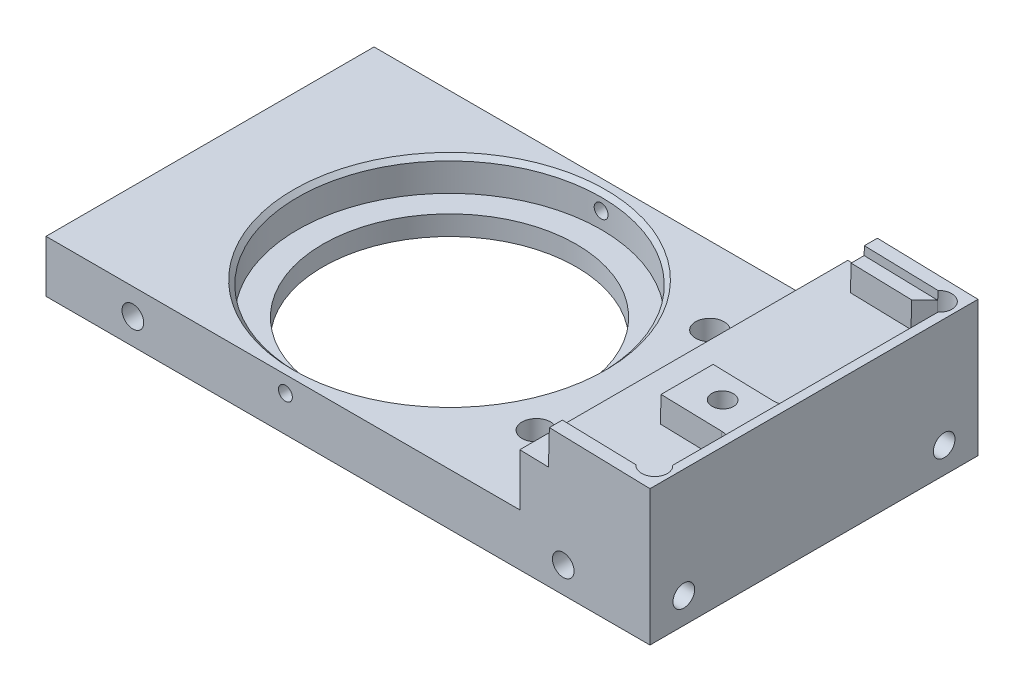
from build123d import *

# Parameters (mm, degrees)
SKETCH1_W                      = 72
SKETCH1_H                      = 37.8
EXTRUDE1_DEPTH                 = 5.9944
SKETCH2_W                      = 15
SKETCH2_H                      = 37.8
EXTRUDE2_DEPTH                 = 10.0056
EXTRUDE3_DEPTH                 = 49.756640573
EXTRUDE3_DEPTH_BACK            = 49.756640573
SKETCH4_R                      = 14.6
EXTRUDE4_DEPTH                 = 49.756640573
SKETCH7_R                      = 17.5
EXTRUDE5_DEPTH                 = 3.7338
M4X0_7_TAPPED_HOLE1_D          = 3.3
EXTRUDE6_DEPTH                 = 1
EXTRUDE7_DEPTH                 = 4
M3X0_5_TAPPED_HOLE2_D          = 2.5
M3X0_5_TAPPED_HOLE2_DEPTH      = 7.874
M3X0_5_TAPPED_HOLE2_TIP        = 0.751075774
M3X0_5_TAPPED_HOLE3_D          = 2.5
M3X0_5_TAPPED_HOLE3_DEPTH      = 9.0678
M3X0_5_TAPPED_HOLE3_TIP        = 0.751075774
FILLET1_R                      = 1.5
CHAMFER1_SIZE                  = 0.5
CHAMFER2_SIZE                  = 0.5
M3X0_5_TAPPED_HOLE5_D          = 2.5
M3X0_5_TAPPED_HOLE5_DEPTH      = 8.5
M3X0_5_TAPPED_HOLE5_TIP        = 0.751075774
M3X0_5_TAPPED_HOLE4_AT_2_COUNT = 2
M3X0_5_TAPPED_HOLE4_AT_2_PITCH = 49.5935
M2X0_4_TAPPED_HOLE1_REACH      = 60.727
M2X0_4_TAPPED_HOLE1_BORE_R     = 0.8
SKETCH17_W                     = 14.483976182
SKETCH17_H                     = 52.484512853
EXTRUDE8_DEPTH                 = 48.482675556
SKETCH22_W                     = 9.961400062
SKETCH22_H                     = 49.55873521
EXTRUDE9_DEPTH                 = 49.727448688


with BuildPart() as part:
    # Sketch1 → Extrude1 (new body)
    with BuildSketch(Plane(origin=(0, 0, 0), x_dir=(1, 0, 0), z_dir=(0, 1, 0))):
        with Locations((6, 0)):
            Rectangle(SKETCH1_W, SKETCH1_H)
    extrude(amount=EXTRUDE1_DEPTH)

    # Sketch2 → Extrude2 (add)
    with BuildSketch(Plane(origin=(0, 5.9944, 0), x_dir=(1, 0, 0), z_dir=(0, 1, 0))):
        with Locations((34.5, 0)):
            Rectangle(SKETCH2_W, SKETCH2_H)
    extrude(amount=EXTRUDE2_DEPTH)

    # Sketch3 → Extrude3 (cut, two sides: drawn at the far end of the back side and taken through both)
    with BuildSketch(Plane.XY.offset(-EXTRUDE3_DEPTH_BACK)):
        Polygon((27, 16), (42, 15.607211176), (42, 16), align=None)
    extrude(amount=EXTRUDE3_DEPTH + EXTRUDE3_DEPTH_BACK, mode=Mode.SUBTRACT)

    # Sketch4 → Extrude4 (cut, through all)
    with BuildSketch(Plane.XZ):
        with Locations(Location((0.0011, 0, 0), (0, 0, 270))):
            Circle(SKETCH4_R)
    extrude(amount=-EXTRUDE4_DEPTH, mode=Mode.SUBTRACT)

    # Sketch7 → Extrude5 (cut)
    with BuildSketch(Plane(origin=(0, 5.9944, 0), x_dir=(1, 0, 0), z_dir=(0, 1, 0))):
        with Locations(Location((0.0011, 0, 0), (0, 0, 270))):
            Circle(SKETCH7_R)
    extrude(amount=-EXTRUDE5_DEPTH, mode=Mode.SUBTRACT)

    # M4x0.7 Tapped Hole1 (through all)
    with Locations(Plane.XZ):
        with Locations((20, 10), (20, -10)):
            Hole(M4X0_7_TAPPED_HOLE1_D / 2)

    # Sketch8 → Extrude6 (cut)
    with BuildSketch(Plane(origin=(0.437188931, 16.695571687, 0), x_dir=(0.9996573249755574, -0.02617694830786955, 0), z_dir=(0.02617694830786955, 0.9996573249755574, 0))):
        Polygon((40.577058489, 17.400000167), (24.218274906, 17.400002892), (24.218274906, -17.400002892), (40.577058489, -17.400000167), align=None)
    extrude(amount=-EXTRUDE6_DEPTH, mode=Mode.SUBTRACT)

    # Sketch10 → Extrude7 (cut)
    with BuildSketch(Plane(origin=(0.437188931, 16.695571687, 0), x_dir=(0.9996573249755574, -0.02617694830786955, 0), z_dir=(0.02617694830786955, 0.9996573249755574, 0))):
        with BuildLine():
            Line((38.459024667, -17.400000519), (22.294517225, -17.400003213))
            Line((22.294517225, -17.400003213), (22.294517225, 15.900003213))
            Line((22.294517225, 15.900003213), (36.95902686, 15.900003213))
            Line((36.95902686, 15.900003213), (38.459024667, 17.400000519))
            ThreePointArc((38.459024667, 17.400000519), (40.637718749, 17.460660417), (40.577058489, 15.281966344))
            Line((40.577058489, 15.281966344), (40.577058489, -2.1))
            Line((40.577058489, -2.1), (32.077058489, -2.1))
            Line((32.077058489, -2.1), (32.077058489, -8.1))
            Line((32.077058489, -8.1), (40.577058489, -8.1))
            Line((40.577058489, -8.1), (40.577058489, -15.281966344))
            ThreePointArc((40.577058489, -15.281966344), (40.637718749, -17.460660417), (38.459024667, -17.400000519))
        make_face()
    extrude(amount=-EXTRUDE7_DEPTH, mode=Mode.SUBTRACT)

    # M3x0.5 Tapped Hole2
    with Locations(Plane.ZY.offset(30)):
        with Locations((-15.0013, 2.9944), (14.9987, 2.9944)):
            Hole(M3X0_5_TAPPED_HOLE2_D / 2, depth=M3X0_5_TAPPED_HOLE2_DEPTH)
            with Locations((0, 0, -(M3X0_5_TAPPED_HOLE2_DEPTH + M3X0_5_TAPPED_HOLE2_TIP / 2))):  # 118° drill point
                Cone(0, M3X0_5_TAPPED_HOLE2_D / 2, M3X0_5_TAPPED_HOLE2_TIP, mode=Mode.SUBTRACT)

    # M3x0.5 Tapped Hole3
    with Locations(Plane(origin=(0.411011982, 15.695914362, 0), x_dir=(-0.9996573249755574, 0.02617694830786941, 0), z_dir=(0.02617694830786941, 0.9996573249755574, 0))):
        with Locations((-36.077058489, 5)):
            Hole(M3X0_5_TAPPED_HOLE3_D / 2, depth=M3X0_5_TAPPED_HOLE3_DEPTH)
            with Locations((0, 0, -(M3X0_5_TAPPED_HOLE3_DEPTH + M3X0_5_TAPPED_HOLE3_TIP / 2))):  # 118° drill point
                Cone(0, M3X0_5_TAPPED_HOLE3_D / 2, M3X0_5_TAPPED_HOLE3_TIP, mode=Mode.SUBTRACT)

    # Fillet1
    fillet1_edges = [part.edges().sort_by_distance(p)[0] for p in [
        (40.934900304, 13.134244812, 2.1),
        (40.934900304, 13.134244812, 8.1),
    ]]
    fillet(fillet1_edges, radius=FILLET1_R)

    # Chamfer1
    chamfer1_edges = [part.edges().sort_by_distance(p)[0] for p in [
        (0.0011, 5.9944, -17.5),
    ]]
    chamfer(chamfer1_edges, length=CHAMFER1_SIZE)

    # Chamfer2
    chamfer2_edges = [part.edges().sort_by_distance(p)[0] for p in [
        (-30, 2.9972, 18.9),
        (-30, 2.9972, -18.9),
    ]]
    chamfer(chamfer2_edges, length=CHAMFER2_SIZE)

    # M3x0.5 Tapped Hole5
    with Locations(Plane(origin=(42, 0, 0), x_dir=(0, 0, -1), z_dir=(1, 0, 0))):
        with Locations((-15, 2.9944), (15, 2.9944)):
            Hole(M3X0_5_TAPPED_HOLE5_D / 2, depth=M3X0_5_TAPPED_HOLE5_DEPTH)
            with Locations((0, 0, -(M3X0_5_TAPPED_HOLE5_DEPTH + M3X0_5_TAPPED_HOLE5_TIP / 2))):  # 118° drill point
                Cone(0, M3X0_5_TAPPED_HOLE5_D / 2, M3X0_5_TAPPED_HOLE5_TIP, mode=Mode.SUBTRACT)

    # Sketch15 → M3x0.5 Tapped Hole4 (revolve, cut)
    with BuildSketch(Plane(origin=(-17.5884, 2.9972, 18.9), x_dir=(0, -1, 0), z_dir=(1, 0, 0))):
        Polygon((0, 0), (0, 9.818875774), (1.25, 9.0678), (1.25, 0), align=None)
    m3x0_5_tapped_hole4 = revolve(axis=Axis((-17.5884, 2.9972, 25.25), (0, 0, -1)), mode=Mode.SUBTRACT)

    # M3x0.5 Tapped Hole4 at 2: M3x0.5 Tapped Hole4 ×2
    with Locations(*[(i * M3X0_5_TAPPED_HOLE4_AT_2_PITCH, 0, 0) for i in range(1, M3X0_5_TAPPED_HOLE4_AT_2_COUNT)]):
        add(m3x0_5_tapped_hole4, mode=Mode.SUBTRACT)

    # M2x0.4 Tapped Hole1 bore → M2x0.4 Tapped Hole1 (cut, up to next)
    with BuildSketch(Plane.XY.offset(18.9), mode=Mode.PRIVATE) as m2x0_4_tapped_hole1_sk1:
        with Locations((-0.0116, 4.1275)):
            Circle(M2X0_4_TAPPED_HOLE1_BORE_R)
    m2x0_4_tapped_hole1_tool1 = extrude(m2x0_4_tapped_hole1_sk1.sketch, amount=-M2X0_4_TAPPED_HOLE1_REACH, mode=Mode.PRIVATE) & part.part
    m2x0_4_tapped_hole1 = m2x0_4_tapped_hole1_tool1.solids().sort_by_distance((-0.0116, 4.1275, 18.9))[0]
    add(m2x0_4_tapped_hole1, mode=Mode.SUBTRACT)

    # Mirror1: M3x0.5 Tapped Hole4, M2x0.4 Tapped Hole1 across plane
    add(m3x0_5_tapped_hole4.mirror(Plane.XY), mode=Mode.SUBTRACT)
    add(m2x0_4_tapped_hole1.mirror(Plane.XY), mode=Mode.SUBTRACT)

    # Mirror1 copy 1 sketch → Mirror1 copy 1 (revolve, cut)
    with BuildSketch(Plane(origin=(32.0051, 2.9972, -18.9), x_dir=(0, -1, 0), z_dir=(1, 0, 0))):
        Polygon((0, 0), (0, -9.818875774), (1.25, -9.0678), (1.25, 0), align=None)
    revolve(axis=Axis((32.0051, 2.9972, -25.25), (0, 0, -1)), mode=Mode.SUBTRACT)

    # Sketch17 → Extrude8 (cut, through all)
    with BuildSketch(Plane(origin=(0.332481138, 12.696942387, 0), x_dir=(0.9996573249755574, -0.02617694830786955, 0), z_dir=(0.02617694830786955, 0.9996573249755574, 0))):
        with Locations((22.736672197, -1.078826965)):
            Rectangle(SKETCH17_W, SKETCH17_H)
    extrude(amount=EXTRUDE8_DEPTH, mode=Mode.SUBTRACT)

    # Sketch22 → Extrude9 (cut, through all)
    with BuildSketch(Plane(origin=(0, 0, 0), x_dir=(1, 0, 0), z_dir=(0, 1, 0))):
        with Locations((-32.580700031, -0.971932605)):
            Rectangle(SKETCH22_W, SKETCH22_H)
    extrude(amount=EXTRUDE9_DEPTH, mode=Mode.SUBTRACT)


solid = part.part
